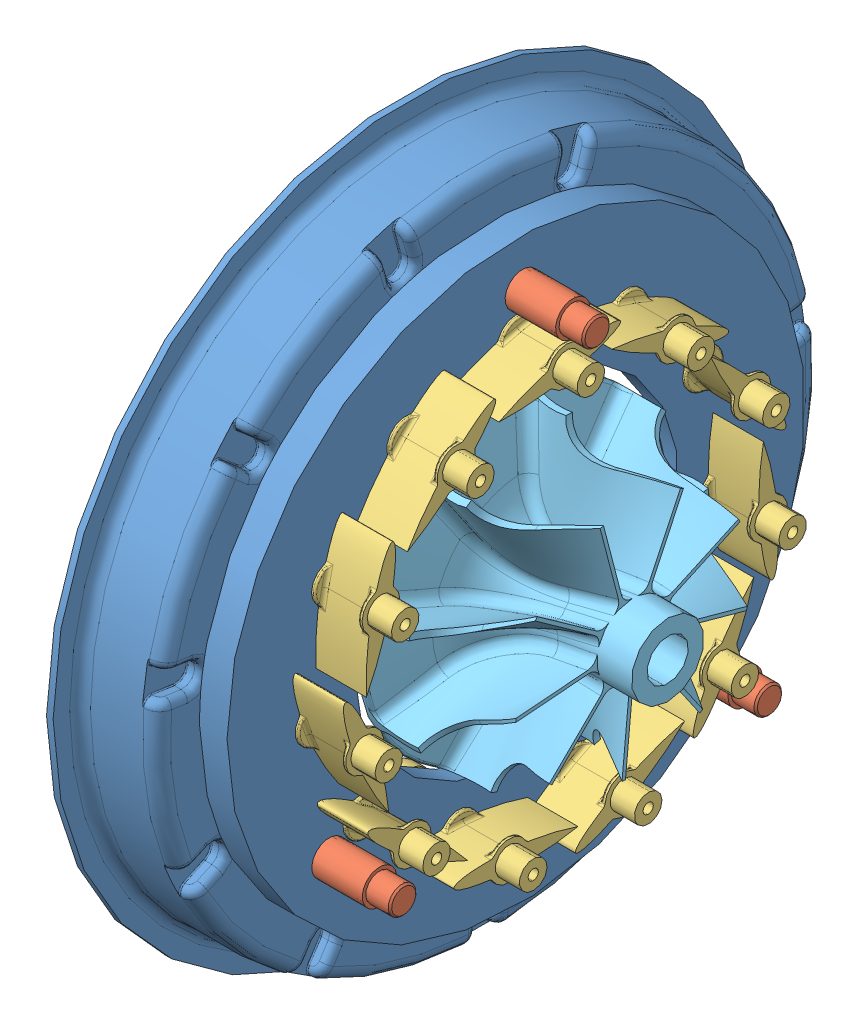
SolidWorks assembly Stator_avec_Turbine.SLDASM, configuration Défaut (file format 3100). Lengths in mm.
Overall size (41.43 131.99 132.01).
19 component instances, 6 part files, 37 mates.
Components (placement in the parent):
- Support_aubes-1: Support_aubes.SLDASM [Défaut] at origin size (38 103.8 103.8)
  - Flasque_2_v2-1: Flasque_2_v2.SLDPRT [Défaut] at origin size (19.5 103.8 103.8)
  - Entretoise-1: Entretoise.SLDPRT [Défaut] at (-2 34.988 -0.9162) size (16.8 5 5)
  - Entretoise-2: Entretoise.SLDPRT [Défaut] at (-2 -22.2199 27.0421) size (16.8 5 5)
  - Entretoise-3: Entretoise.SLDPRT [Défaut] at (-2 -23.6047 -25.8422) size (16.8 5 5)
  - Flasque_1-1: Flasque_1.SLDPRT [Défaut] at (11.3 0 0) x (-1 0 0) z (0 0 -1) size (11.2 83.5 83.5)
- Aube-1: Aube.SLDPRT [Défaut] at (4 24.817 -15.9489) x (0 -0.348708 -0.937231) z (1 0 0) size (18 19.29 20.8)
- Bague_commande-1: Bague_commande.SLDPRT [Défaut] at (-5.2 0 0) x (0 0.783272 0.621679) z (1 0 0) size (93.91 94 2)
- Aube-2: Aube.SLDPRT [Défaut] at (4 29.5 0) x (0 0.213353 -0.976975) z (1 0 0) size (18 19.29 20.8)
- Aube-3: Aube.SLDPRT [Défaut] at (4 24.817 15.9489) x (0 0.707677 -0.706536) z (1 0 0) size (18 19.29 20.8)
- Aube-4: Aube.SLDPRT [Défaut] at (4 12.2547 26.8341) x (0 0.977318 -0.211777) z (1 0 0) size (18 19.29 20.8)
- Aube-5: Aube.SLDPRT [Défaut] at (4 -4.1983 29.1997) x (0 0.936668 0.35022) z (1 0 0) size (18 19.29 20.8)
- Aube-6: Aube.SLDPRT [Défaut] at (4 -19.3184 22.2946) x (0 0.598632 0.801024) z (1 0 0) size (18 19.29 20.8)
- Aube-7: Aube.SLDPRT [Défaut] at (4 -28.305 8.3111) x (0 0.070535 0.997509) z (1 0 0) size (18 19.29 20.8)
- Aube-8: Aube.SLDPRT [Défaut] at (4 -4.1983 -29.1997) x (0 -0.997394 -0.072144) z (1 0 0) size (18 19.29 20.8)
- Aube-9: Aube.SLDPRT [Défaut] at (4 -28.305 -8.3111) x (0 -0.479957 0.877292) z (1 0 0) size (18 19.29 20.8)
- Aube-10: Aube.SLDPRT [Défaut] at (4 -19.3184 -22.2946) x (0 -0.878065 0.478541) z (1 0 0) size (18 19.29 20.8)
- Aube-11: Aube.SLDPRT [Défaut] at (4 12.2547 -26.8341) x (0 -0.800058 -0.599923) z (1 0 0) size (18 19.29 20.8)
- Turbine-1: Turbine.SLDPRT [Défaut] at (2.9271 0 0) x (0 -0.634988 -0.772522) z (0 -0.772522 0.634988) size (44.34 30 44.41)
Mates (geometry in assembly coordinates):
- Coaxiale1: concentric aligned: cylinder of Support_aubes-1/Flasque_2_v2-1; cylinder of Aube-1
- Coïncidente1: coincident anti-aligned: plane of Support_aubes-1/Flasque_2_v2-1 through (4 41.8 0) normal (1 0 0); plane of Aube-1 through (4 24.817 -15.9489) normal (-1 0 0)
- Coaxiale2: concentric anti-aligned: cylinder of Support_aubes-1/Flasque_2_v2-1; cylinder of Bague_commande-1
- Coïncidente2: coincident anti-aligned: plane of Support_aubes-1/Flasque_2_v2-1 through (-3.2 6.1978 -43.1067) normal (-1 0 0); plane of Bague_commande-1 through (-3.2 0 0) normal (1 0 0)
- Tangent1: tangent anti-aligned: cylinder of Aube-1; plane of Bague_commande-1 through (-5.2 1.7292 2.4515) normal (0 -0.576397 -0.81717)
- Coaxiale3: concentric aligned: cylinder of Support_aubes-1/Flasque_2_v2-1; cylinder of Aube-2
- Coïncidente3: coincident anti-aligned: plane of Support_aubes-1/Flasque_2_v2-1 through (4 41.8 0) normal (1 0 0); plane of Aube-2 through (4 29.5 0) normal (-1 0 0)
- Tangent2: tangent anti-aligned: plane of Bague_commande-1 through (-5.2 0.1293 2.9972) normal (0 -0.043101 -0.999071); cylinder of Aube-2
- Coaxiale5: concentric aligned: cylinder of Support_aubes-1/Flasque_2_v2-1; cylinder of Aube-3
- Coïncidente4: coincident anti-aligned: plane of Support_aubes-1/Flasque_2_v2-1 through (4 41.8 0) normal (1 0 0); plane of Aube-3 through (4 24.817 15.9489) normal (-1 0 0)
- Tangent3: tangent anti-aligned: plane of Bague_commande-1 through (-5.2 -1.5116 2.5913) normal (0 0.50388 -0.863774); cylinder of Aube-3
- Coaxiale6: concentric aligned: cylinder of Support_aubes-1/Flasque_2_v2-1; cylinder of Aube-4
- Tangent4: tangent anti-aligned: plane of Bague_commande-1 through (-5.2 -2.6726 1.3627) normal (0 0.890882 -0.454235); cylinder of Aube-4
- Coïncidente6: coincident anti-aligned: plane of Support_aubes-1/Flasque_2_v2-1 through (4 41.8 0) normal (1 0 0); plane of Aube-4 through (4 12.2547 26.8341) normal (-1 0 0)
- Coaxiale7: concentric aligned: cylinder of Support_aubes-1/Flasque_2_v2-1; cylinder of Aube-5
- Coïncidente7: coincident anti-aligned: plane of Support_aubes-1/Flasque_2_v2-1 through (4 41.8 0) normal (1 0 0); plane of Aube-5 through (4 -4.1983 29.1997) normal (-1 0 0)
- Tangent5: tangent anti-aligned: plane of Bague_commande-1 through (-5.2 -2.9851 -0.2986) normal (0 0.995036 0.09952); cylinder of Aube-5
- Coaxiale8: concentric aligned: cylinder of Support_aubes-1/Flasque_2_v2-1; cylinder of Aube-6
- Coïncidente8: coincident anti-aligned: plane of Support_aubes-1/Flasque_2_v2-1 through (4 41.8 0) normal (1 0 0); plane of Aube-6 through (4 -19.3184 22.2946) normal (-1 0 0)
- Tangent6: tangent anti-aligned: plane of Bague_commande-1 through (-5.2 -2.3498 -1.865) normal (0 0.783272 0.621679); cylinder of Aube-6
- Coaxiale9: concentric aligned: cylinder of Support_aubes-1/Flasque_2_v2-1; cylinder of Aube-7
- Coïncidente9: coincident anti-aligned: plane of Support_aubes-1/Flasque_2_v2-1 through (4 41.8 0) normal (1 0 0); plane of Aube-7 through (4 -28.305 8.3111) normal (-1 0 0)
- Tangent7: tangent anti-aligned: plane of Bague_commande-1 through (-5.2 -0.9685 -2.8394) normal (0 0.322826 0.946458); cylinder of Aube-7
- Coaxiale10: concentric aligned: cylinder of Support_aubes-1/Flasque_2_v2-1; cylinder of Aube-9
- Coïncidente10: coincident anti-aligned: plane of Support_aubes-1/Flasque_2_v2-1 through (4 41.8 0) normal (1 0 0); plane of Aube-9 through (4 -28.305 -8.3111) normal (-1 0 0)
- Tangent8: tangent anti-aligned: plane of Bague_commande-1 through (-5.2 0.7203 -2.9122) normal (0 -0.240116 0.970744); cylinder of Aube-9
- Coaxiale11: concentric aligned: cylinder of Support_aubes-1/Flasque_2_v2-1; cylinder of Aube-10
- Coïncidente11: coincident anti-aligned: plane of Support_aubes-1/Flasque_2_v2-1 through (4 41.8 0) normal (1 0 0); plane of Aube-10 through (4 -19.3184 -22.2946) normal (-1 0 0)
- Tangent9: tangent anti-aligned: plane of Bague_commande-1 through (-5.2 2.1805 -2.0605) normal (0 -0.726822 0.686826); cylinder of Aube-10
- Coaxiale12: concentric aligned: cylinder of Support_aubes-1/Flasque_2_v2-1; cylinder of Aube-8
- Coïncidente13: coincident anti-aligned: plane of Support_aubes-1/Flasque_2_v2-1 through (4 41.8 0) normal (1 0 0); plane of Aube-8 through (4 -4.1983 -29.1997) normal (-1 0 0)
- Tangent11: tangent anti-aligned: plane of Bague_commande-1 through (-5.2 2.9483 -0.5545) normal (0 -0.982768 0.184845); cylinder of Aube-8
- Coaxiale13: concentric aligned: cylinder of Support_aubes-1/Flasque_2_v2-1; cylinder of Aube-11
- Coïncidente14: coincident anti-aligned: plane of Support_aubes-1/Flasque_2_v2-1 through (4 41.8 0) normal (1 0 0); plane of Aube-11 through (4 12.2547 -26.8341) normal (-1 0 0)
- Tangent12: tangent anti-aligned: plane of Bague_commande-1 through (-5.2 2.7801 1.1275) normal (0 -0.926692 -0.375823); cylinder of Aube-11
- Coaxiale14: concentric aligned: cylinder of Support_aubes-1/Flasque_1-1; cylinder of Turbine-1
- Coïncidente15: coincident aligned: plane of Support_aubes-1/Flasque_2_v2-1 through (4 41.8 0) normal (1 0 0); circle of Turbine-1 centre (4 0 0) axis (1 0 0)
